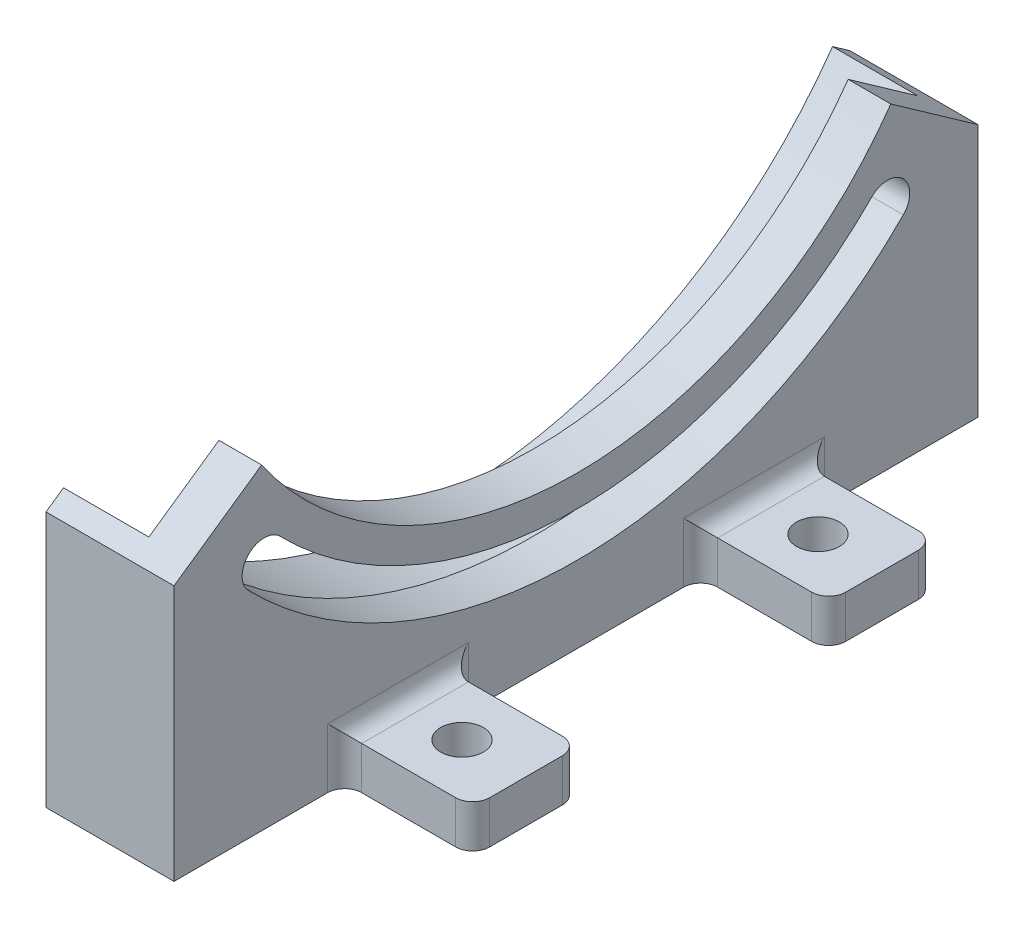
from build123d import *

# Parameters (mm, degrees)
BOSS_EXTRUDE2_DEPTH = 6.35
CUT_EXTRUDE1_DEPTH  = 6.35
BOSS_EXTRUDE3_START = 12.7
BOSS_EXTRUDE3_DEPTH = 12.7
BOSS_EXTRUDE4_DEPTH = 19.05
SKETCH5_W           = 19.05
SKETCH5_H           = 15.875
SKETCH5_R           = 3.175
BOSS_EXTRUDE5_DEPTH = 6.35
FILLET1_R           = 2.54


with BuildPart() as part:
    # Sketch1 → Boss-Extrude2 (new body)
    with BuildSketch(Plane(origin=(0, 0, 0), x_dir=(0, 0, -1), z_dir=(1, 0, 0))):
        with BuildLine():
            Line((-59.961556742, -41.680479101), (-46.926435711, -32.619505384))
            ThreePointArc((-46.926435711, -32.619505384), (-0.182383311, -57.149708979), (46.717283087, -32.91835295))
            Line((46.717283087, -32.91835295), (59.694306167, -42.062339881))
            ThreePointArc((59.694306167, -42.062339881), (-0.233045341, -73.024628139), (-59.961556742, -41.680479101))
        make_face()
    extrude(amount=BOSS_EXTRUDE2_DEPTH)

    # Sketch2 → Cut-Extrude1 (cut)
    with BuildSketch(Plane(origin=(6.35, 0, 0), x_dir=(0, 0, -1), z_dir=(1, 0, 0))):
        with BuildLine():
            ThreePointArc((-44.166707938, -43.20590145), (-48.8361588, -43.154553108), (-48.887507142, -47.824003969))
            ThreePointArc((-48.887507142, -47.824003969), (-0.218252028, -68.389151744), (48.581270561, -48.135058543))
            ThreePointArc((48.581270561, -48.135058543), (48.559726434, -43.465375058), (43.890042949, -43.486919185))
            ThreePointArc((43.890042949, -43.486919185), (-0.197176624, -61.785185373), (-44.166707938, -43.20590145))
        make_face()
    extrude(amount=-CUT_EXTRUDE1_DEPTH, mode=Mode.SUBTRACT)

    # Sketch3 → Boss-Extrude3 (add)
    with BuildSketch(Plane.ZY.offset(BOSS_EXTRUDE3_START)):
        with BuildLine():
            Line((-59.694306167, -42.062339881), (-57.098901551, -40.233542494))
            ThreePointArc((-57.098901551, -40.233542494), (0.222912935, -69.849644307), (57.354532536, -39.868284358))
            Line((57.354532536, -39.868284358), (59.961556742, -41.680479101))
            ThreePointArc((59.961556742, -41.680479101), (0.233045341, -73.024628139), (-59.694306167, -42.062339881))
        make_face()
    extrude(amount=-BOSS_EXTRUDE3_DEPTH)

    # Sketch4 → Boss-Extrude4 (add, through all)
    with BuildSketch(Plane(origin=(6.35, 0, 0), x_dir=(0, 0, -1), z_dir=(1, 0, 0))):
        with BuildLine():
            Line((-59.961556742, -41.680479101), (-59.961556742, -79.780479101))
            Line((-59.961556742, -79.780479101), (59.694306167, -79.780479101))
            Line((59.694306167, -79.780479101), (59.694306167, -42.062339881))
            ThreePointArc((59.694306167, -42.062339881), (-0.233045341, -73.024628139), (-59.961556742, -41.680479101))
        make_face()
    extrude(amount=-BOSS_EXTRUDE4_DEPTH)

    # Sketch5 → Boss-Extrude5 (add)
    # profile 1 of 2: a face of its own
    with BuildSketch(Plane.XZ.offset(79.780479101)):
        with Locations((15.875, 26.624056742)):
            Rectangle(SKETCH5_W, SKETCH5_H)
        with Locations(Location((15.875, 26.624056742, 0), (0, 0, 270))):
            Circle(SKETCH5_R, mode=Mode.SUBTRACT)
    # profile 2 of 2: a face of its own
    with BuildSketch(Plane.XZ.offset(79.780479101)):
        with Locations((15.875, -26.356806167)):
            Rectangle(SKETCH5_W, SKETCH5_H)
        with Locations(Location((15.875, -26.356806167, 0), (0, 0, 270))):
            Circle(SKETCH5_R, mode=Mode.SUBTRACT)
    extrude(amount=-BOSS_EXTRUDE5_DEPTH)

    # Fillet1
    fillet1_edges = [part.edges().sort_by_distance(p)[0] for p in [
        (6.35, -73.430479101, 26.624056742),
        (6.35, -76.605479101, 18.686556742),
        (6.35, -76.605479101, 34.561556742),
        (25.4, -76.605479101, 34.561556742),
        (25.4, -76.605479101, 18.686556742),
        (6.35, -73.430479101, -26.356806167),
        (6.35, -76.605479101, -34.294306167),
        (6.35, -76.605479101, -18.419306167),
        (25.4, -76.605479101, -18.419306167),
        (25.4, -76.605479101, -34.294306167),
    ]]
    fillet(fillet1_edges, radius=FILLET1_R)


solid = part.part
